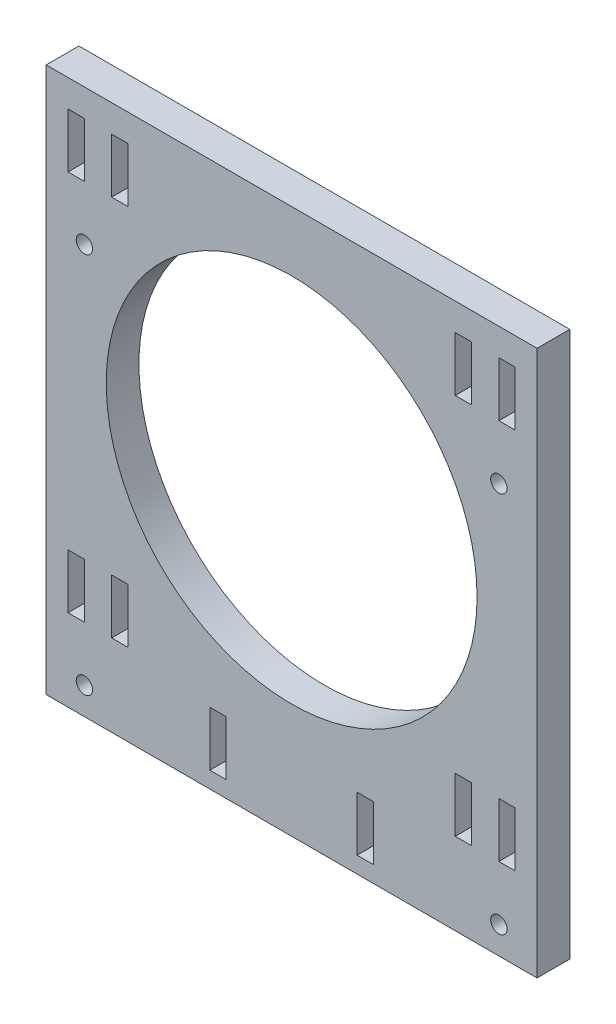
from build123d import *

# Parameters (mm, degrees)
SKETCH_3_R          = 34
EXTRUDE_2_DEPTH     = 6
SKETCH_5_W          = 3
SKETCH_5_H          = 10
CUT_EXTRUDE_2_DEPTH = 72.316197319
SKETCH_6_R          = 1.5
SKETCH_6_W          = 3
SKETCH_6_H          = 10
CUT_EXTRUDE_3_DEPTH = 10


with BuildPart() as part:
    # Sketch 3 → Extrude 2 (new body)
    with BuildSketch(Plane.XY):
        Polygon((45, 45), (-45, 45), (-45, -45), (-45, -55), (45, -55), (45, -45), align=None)
        Circle(SKETCH_3_R, mode=Mode.SUBTRACT)
    extrude(amount=EXTRUDE_2_DEPTH)

    # Sketch 5 → Cut-Extrude 2 (cut, through all)
    with BuildSketch(Plane.XY.offset(6)):
        with Locations((-31.5, 35)):
            Rectangle(SKETCH_5_W, SKETCH_5_H)
        with Locations((31.5, 35)):
            Rectangle(SKETCH_5_W, SKETCH_5_H)
        with Locations((-31.5, -35)):
            Rectangle(SKETCH_5_W, SKETCH_5_H)
        with Locations((31.5, -35)):
            Rectangle(SKETCH_5_W, SKETCH_5_H)
    extrude(amount=-CUT_EXTRUDE_2_DEPTH, mode=Mode.SUBTRACT)

    # Sketch 6 → Cut-Extrude 3 (cut)
    with BuildSketch(Plane.XY.offset(6)):
        with Locations((-38, -50)):
            Circle(SKETCH_6_R)
        with Locations((-38, 20)):
            Circle(SKETCH_6_R)
        with Locations((38, 20)):
            Circle(SKETCH_6_R)
        with Locations((38, -50)):
            Circle(SKETCH_6_R)
        with Locations((-39.5, -35)):
            Rectangle(SKETCH_6_W, SKETCH_6_H)
        with Locations((-39.5, 35)):
            Rectangle(SKETCH_6_W, SKETCH_6_H)
        with Locations((-13.5, -47)):
            Rectangle(SKETCH_6_W, SKETCH_6_H)
        with Locations((13.5, -47)):
            Rectangle(SKETCH_6_W, SKETCH_6_H)
        with Locations((39.5, 35)):
            Rectangle(SKETCH_6_W, SKETCH_6_H)
        with Locations((39.5, -35)):
            Rectangle(SKETCH_6_W, SKETCH_6_H)
    extrude(amount=-CUT_EXTRUDE_3_DEPTH, mode=Mode.SUBTRACT)


solid = part.part
